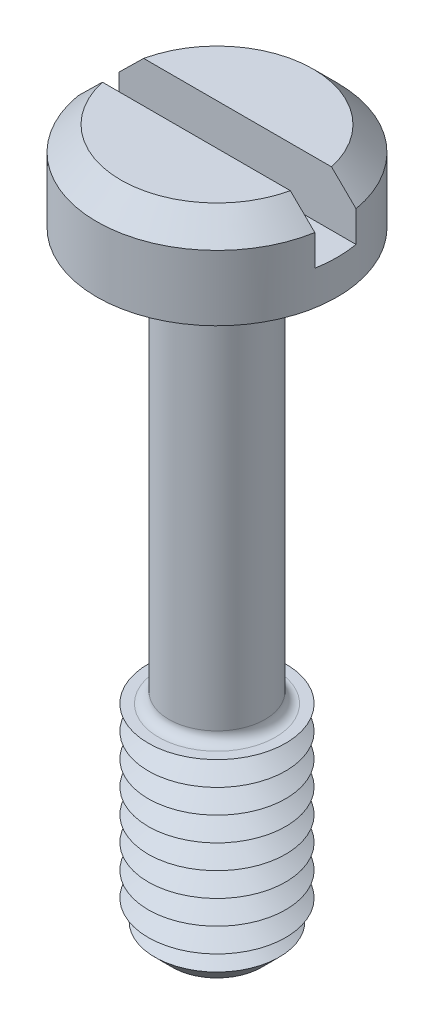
ISO-10303-21;
HEADER;
FILE_DESCRIPTION(('STEP AP214'),'2;1');
FILE_NAME('part.step','',(''),(''),'','','');
FILE_SCHEMA(('AUTOMOTIVE_DESIGN { 1 0 10303 214 1 1 1 1 }'));
ENDSEC;
DATA;
#1=APPLICATION_CONTEXT('core data for automotive mechanical design processes');
#2=APPLICATION_PROTOCOL_DEFINITION('international standard','automotive_design',2000,#1);
#3=PRODUCT_CONTEXT('',#1,'mechanical');
#4=PRODUCT('Part','Part','',(#3));
#5=PRODUCT_RELATED_PRODUCT_CATEGORY('part','',(#4));
#6=PRODUCT_DEFINITION_FORMATION('','',#4);
#7=PRODUCT_DEFINITION_CONTEXT('part definition',#1,'design');
#8=PRODUCT_DEFINITION('design','',#6,#7);
#9=PRODUCT_DEFINITION_SHAPE('','',#8);
#10=(LENGTH_UNIT() NAMED_UNIT(*) SI_UNIT(.MILLI.,.METRE.));
#11=(NAMED_UNIT(*) PLANE_ANGLE_UNIT() SI_UNIT($,.RADIAN.));
#12=(NAMED_UNIT(*) SI_UNIT($,.STERADIAN.) SOLID_ANGLE_UNIT());
#13=UNCERTAINTY_MEASURE_WITH_UNIT(LENGTH_MEASURE(1.E-05),#10,'distance_accuracy_value','');
#14=(GEOMETRIC_REPRESENTATION_CONTEXT(3) GLOBAL_UNCERTAINTY_ASSIGNED_CONTEXT((#13)) GLOBAL_UNIT_ASSIGNED_CONTEXT((#10,
#11,#12)) REPRESENTATION_CONTEXT('',''));
#15=CARTESIAN_POINT('',(0.,0.,0.));
#16=DIRECTION('',(0.,0.,1.));
#17=DIRECTION('',(1.,0.,0.));
#18=AXIS2_PLACEMENT_3D('',#15,#16,#17);
#19=CARTESIAN_POINT('',(0.,2.6,0.));
#20=DIRECTION('',(0.,1.,0.));
#21=DIRECTION('',(0.,0.,1.));
#22=AXIS2_PLACEMENT_3D('',#19,#20,#21);
#23=PLANE('',#22);
#24=DIRECTION('',(-1.,0.,0.));
#25=VECTOR('',#24,1.);
#26=CARTESIAN_POINT('',(3.5,2.6,-0.6));
#27=LINE('',#26,#25);
#28=CARTESIAN_POINT('',(2.73495886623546,2.6,-0.6));
#29=VERTEX_POINT('',#28);
#30=CARTESIAN_POINT('',(-2.73495886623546,2.6,-0.6));
#31=VERTEX_POINT('',#30);
#32=EDGE_CURVE('E110',#29,#31,#27,.T.);
#33=ORIENTED_EDGE('',*,*,#32,.F.);
#34=CARTESIAN_POINT('',(0.,2.6,0.));
#35=DIRECTION('',(0.,1.,0.));
#36=DIRECTION('',(0.,0.,1.));
#37=AXIS2_PLACEMENT_3D('',#34,#35,#36);
#38=CIRCLE('',#37,2.8);
#39=EDGE_CURVE('E113',#29,#31,#38,.T.);
#40=ORIENTED_EDGE('',*,*,#39,.T.);
#41=EDGE_LOOP('',(#33,#40));
#42=FACE_BOUND('',#41,.T.);
#43=ADVANCED_FACE('F39',(#42),#23,.T.);
#44=CARTESIAN_POINT('',(0.,2.6,0.));
#45=DIRECTION('',(0.,-1.,0.));
#46=DIRECTION('',(0.,0.,-1.));
#47=AXIS2_PLACEMENT_3D('',#44,#45,#46);
#48=CONICAL_SURFACE('',#47,2.8,0.785398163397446);
#49=CARTESIAN_POINT('',(7.69779986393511,-2.32114776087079,-0.6));
#50=CARTESIAN_POINT('',(7.42456340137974,-2.04874480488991,-0.6));
#51=CARTESIAN_POINT('',(7.15128998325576,-1.77637887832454,-0.6));
#52=CARTESIAN_POINT('',(6.6046077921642,-1.23176088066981,-0.6));
#53=CARTESIAN_POINT('',(6.3311990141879,-0.959508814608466,-0.6));
#54=CARTESIAN_POINT('',(5.78393918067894,-0.414914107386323,-0.6));
#55=CARTESIAN_POINT('',(5.51008795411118,-0.142571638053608,-0.6));
#56=CARTESIAN_POINT('',(4.96212493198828,0.401829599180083,-0.6));
#57=CARTESIAN_POINT('',(4.68801314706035,0.673888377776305,-0.6));
#58=CARTESIAN_POINT('',(4.15230810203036,1.20471714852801,-0.6));
#59=CARTESIAN_POINT('',(3.8907352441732,1.46350771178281,-0.6));
#60=CARTESIAN_POINT('',(3.49781694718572,1.85115830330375,-0.6));
#61=CARTESIAN_POINT('',(3.36674319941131,1.98029362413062,-0.6));
#62=CARTESIAN_POINT('',(3.10433907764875,2.23830030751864,-0.6));
#63=CARTESIAN_POINT('',(2.97300870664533,2.36717167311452,-0.6));
#64=CARTESIAN_POINT('',(2.71005235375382,2.62445652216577,-0.6));
#65=CARTESIAN_POINT('',(2.57842659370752,2.75287023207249,-0.6));
#66=CARTESIAN_POINT('',(2.31459302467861,3.00911021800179,-0.6));
#67=CARTESIAN_POINT('',(2.1823851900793,3.13693646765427,-0.6));
#68=CARTESIAN_POINT('',(1.91706128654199,3.39159289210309,-0.6));
#69=CARTESIAN_POINT('',(1.78394541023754,3.51842326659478,-0.6));
#70=CARTESIAN_POINT('',(1.5829745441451,3.70728046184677,-0.6));
#71=CARTESIAN_POINT('',(1.51577053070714,3.76999922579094,-0.6));
#72=CARTESIAN_POINT('',(1.38073587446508,3.89475766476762,-0.6));
#73=CARTESIAN_POINT('',(1.31290524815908,3.95679735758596,-0.6));
#74=CARTESIAN_POINT('',(1.20662362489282,4.05253127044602,-0.6));
#75=CARTESIAN_POINT('',(1.16849592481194,4.08658409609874,-0.6));
#76=CARTESIAN_POINT('',(1.09186306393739,4.15427097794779,-0.6));
#77=CARTESIAN_POINT('',(1.05335786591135,4.18790499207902,-0.6));
#78=CARTESIAN_POINT('',(0.975560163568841,4.25487029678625,-0.6));
#79=CARTESIAN_POINT('',(0.936263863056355,4.28819718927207,-0.6));
#80=CARTESIAN_POINT('',(0.85702368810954,4.35405392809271,-0.6));
#81=CARTESIAN_POINT('',(0.817079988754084,4.38658398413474,-0.6));
#82=CARTESIAN_POINT('',(0.735932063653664,4.45080389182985,-0.6));
#83=CARTESIAN_POINT('',(0.694719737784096,4.48248357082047,-0.6));
#84=CARTESIAN_POINT('',(0.611023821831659,4.54411116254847,-0.6));
#85=CARTESIAN_POINT('',(0.568540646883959,4.57405963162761,-0.6));
#86=CARTESIAN_POINT('',(0.482031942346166,4.63104137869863,-0.6));
#87=CARTESIAN_POINT('',(0.438018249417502,4.65809235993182,-0.6));
#88=CARTESIAN_POINT('',(0.347545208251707,4.70764477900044,-0.6));
#89=CARTESIAN_POINT('',(0.301093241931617,4.73015905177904,-0.6));
#90=CARTESIAN_POINT('',(0.216840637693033,4.76288589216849,-0.6));
#91=CARTESIAN_POINT('',(0.179711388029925,4.77476119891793,-0.6));
#92=CARTESIAN_POINT('',(0.104069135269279,4.79214056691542,-0.6));
#93=CARTESIAN_POINT('',(0.0655630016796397,4.79767265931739,-0.6));
#94=CARTESIAN_POINT('',(-0.0121083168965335,4.80113734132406,-0.6));
#95=CARTESIAN_POINT('',(-0.0512762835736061,4.79901215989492,-0.6));
#96=CARTESIAN_POINT('',(-0.128601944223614,4.78758103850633,-0.6));
#97=CARTESIAN_POINT('',(-0.166755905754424,4.77825158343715,-0.6));
#98=CARTESIAN_POINT('',(-0.23998525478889,4.75468984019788,-0.6));
#99=CARTESIAN_POINT('',(-0.27512131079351,4.74063623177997,-0.6));
#100=CARTESIAN_POINT('',(-0.343859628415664,4.70912771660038,-0.6));
#101=CARTESIAN_POINT('',(-0.377459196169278,4.69166709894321,-0.6));
#102=CARTESIAN_POINT('',(-0.443620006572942,4.65431398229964,-0.6));
#103=CARTESIAN_POINT('',(-0.476170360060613,4.63440256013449,-0.6));
#104=CARTESIAN_POINT('',(-0.54020885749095,4.59301144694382,-0.6));
#105=CARTESIAN_POINT('',(-0.571697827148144,4.57153301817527,-0.6));
#106=CARTESIAN_POINT('',(-0.636426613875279,4.52565712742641,-0.6));
#107=CARTESIAN_POINT('',(-0.669598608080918,4.50116466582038,-0.6));
#108=CARTESIAN_POINT('',(-0.735238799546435,4.45125092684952,-0.6));
#109=CARTESIAN_POINT('',(-0.767706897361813,4.42582951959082,-0.6));
#110=CARTESIAN_POINT('',(-0.864340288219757,4.34853769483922,-0.6));
#111=CARTESIAN_POINT('',(-0.92770092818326,4.29566444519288,-0.6));
#112=CARTESIAN_POINT('',(-1.05322030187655,4.18829389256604,-0.6));
#113=CARTESIAN_POINT('',(-1.11537654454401,4.13379371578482,-0.6));
#114=CARTESIAN_POINT('',(-1.23879800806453,4.02383276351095,-0.6));
#115=CARTESIAN_POINT('',(-1.30006349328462,3.96837228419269,-0.6));
#116=CARTESIAN_POINT('',(-1.42182653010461,3.85695373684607,-0.6));
#117=CARTESIAN_POINT('',(-1.4823257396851,3.80099747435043,-0.6));
#118=CARTESIAN_POINT('',(-1.60290045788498,3.68862177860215,-0.6));
#119=CARTESIAN_POINT('',(-1.66297593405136,3.63220231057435,-0.6));
#120=CARTESIAN_POINT('',(-1.84259490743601,3.46258196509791,-0.6));
#121=CARTESIAN_POINT('',(-1.96167258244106,3.3488883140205,-0.6));
#122=CARTESIAN_POINT('',(-2.19942862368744,3.12043467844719,-0.6));
#123=CARTESIAN_POINT('',(-2.3181049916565,3.00567262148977,-0.6));
#124=CARTESIAN_POINT('',(-2.55498513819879,2.77566147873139,-0.6));
#125=CARTESIAN_POINT('',(-2.67318891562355,2.66041239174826,-0.6));
#126=CARTESIAN_POINT('',(-3.02733776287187,2.31418176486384,-0.6));
#127=CARTESIAN_POINT('',(-3.26281496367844,2.08272206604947,-0.6));
#128=CARTESIAN_POINT('',(-3.73326607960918,1.61902814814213,-0.6));
#129=CARTESIAN_POINT('',(-3.96823963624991,1.38679356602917,-0.6));
#130=CARTESIAN_POINT('',(-4.43780370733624,0.921942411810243,-0.6));
#131=CARTESIAN_POINT('',(-4.67239422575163,0.689325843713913,-0.6));
#132=CARTESIAN_POINT('',(-5.13982382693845,0.225350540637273,-0.6));
#133=CARTESIAN_POINT('',(-5.37266445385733,-0.00600663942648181,-0.6));
#134=CARTESIAN_POINT('',(-5.8381854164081,-0.46888381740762,-0.6));
#135=CARTESIAN_POINT('',(-6.07086575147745,-0.700403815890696,-0.6));
#136=CARTESIAN_POINT('',(-6.5359692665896,-1.16341429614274,-0.6));
#137=CARTESIAN_POINT('',(-6.76839251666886,-1.39490470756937,-0.6));
#138=CARTESIAN_POINT('',(-7.23315324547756,-1.85796986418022,-0.6));
#139=CARTESIAN_POINT('',(-7.46549072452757,-2.08954460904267,-0.6));
#140=CARTESIAN_POINT('',(-7.69779986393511,-2.32114776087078,-0.6));
#141=B_SPLINE_CURVE_WITH_KNOTS('',3,(#49,#50,#51,#52,#53,#54,#55,#56,#57,#58,#59,#60,#61,#62,
#63,#64,#65,#66,#67,#68,#69,#70,#71,#72,#73,#74,#75,#76,#77,#78,#79,#80,#81,#82,#83,#84,#85,#86,
#87,#88,#89,#90,#91,#92,#93,#94,#95,#96,#97,#98,#99,#100,#101,#102,#103,#104,#105,#106,#107,
#108,#109,#110,#111,#112,#113,#114,#115,#116,#117,#118,#119,#120,#121,#122,#123,#124,#125,#126,
#127,#128,#129,#130,#131,#132,#133,#134,#135,#136,#137,#138,#139,#140),.UNSPECIFIED.,.F.,.F.,(4,
2,2,2,2,2,2,2,2,2,2,2,2,2,2,2,2,2,2,2,2,2,2,2,2,2,2,2,2,2,2,2,2,2,2,2,2,2,2,2,2,2,2,2,2,4),(0.,
1.15747738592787,2.31500139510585,3.47365747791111,4.63226817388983,5.73614050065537,
6.28814234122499,6.84013779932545,7.39180548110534,7.94349768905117,8.49507629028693,
8.7708456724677,9.04660781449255,9.19996738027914,9.35334222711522,9.50791164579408,
9.66243993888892,9.81835637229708,9.9742224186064,10.1290741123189,10.2834813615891,
10.4000294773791,10.5160605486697,10.6329688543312,10.7502603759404,10.8635386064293,
10.9770083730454,11.0914168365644,11.205734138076,11.3294140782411,11.4531113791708,
11.7006314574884,11.9486181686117,12.1965297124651,12.4437540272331,12.6909970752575,
13.184904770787,13.6801705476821,14.1754375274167,15.1659939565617,16.1571087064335,
17.1482131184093,18.1329303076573,19.1176509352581,20.1017623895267,21.0858701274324),.UNSPECIFIED.);
#142=CARTESIAN_POINT('',(3.44818792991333,1.89999999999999,-0.6));
#143=VERTEX_POINT('',#142);
#144=EDGE_CURVE('E259',#143,#29,#141,.T.);
#145=ORIENTED_EDGE('',*,*,#144,.F.);
#146=CARTESIAN_POINT('',(0.,1.89999999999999,0.));
#147=DIRECTION('',(0.,1.,0.));
#148=DIRECTION('',(0.,0.,1.));
#149=AXIS2_PLACEMENT_3D('',#146,#147,#148);
#150=CIRCLE('',#149,3.5);
#151=CARTESIAN_POINT('',(-3.44818792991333,1.89999999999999,-0.6));
#152=VERTEX_POINT('',#151);
#153=EDGE_CURVE('E128',#152,#143,#150,.F.);
#154=ORIENTED_EDGE('',*,*,#153,.F.);
#155=EDGE_CURVE('E102',#31,#152,#141,.T.);
#156=ORIENTED_EDGE('',*,*,#155,.F.);
#157=ORIENTED_EDGE('',*,*,#39,.F.);
#158=EDGE_LOOP('',(#145,#154,#156,#157));
#159=FACE_BOUND('',#158,.T.);
#160=ADVANCED_FACE('F222',(#159),#48,.T.);
#161=CARTESIAN_POINT('',(0.,-18.,0.));
#162=DIRECTION('',(0.,1.,0.));
#163=DIRECTION('',(0.,0.,1.));
#164=AXIS2_PLACEMENT_3D('',#161,#162,#163);
#165=CYLINDRICAL_SURFACE('',#164,1.4);
#166=CARTESIAN_POINT('',(0.,-11.7,0.));
#167=DIRECTION('',(0.,-1.,0.));
#168=DIRECTION('',(0.,0.,-1.));
#169=AXIS2_PLACEMENT_3D('',#166,#167,#168);
#170=CIRCLE('',#169,1.4);
#171=CARTESIAN_POINT('',(0.,-11.7,-1.4));
#172=VERTEX_POINT('',#171);
#173=EDGE_CURVE('E123',#172,#172,#170,.F.);
#174=ORIENTED_EDGE('',*,*,#173,.T.);
#175=EDGE_LOOP('',(#174));
#176=FACE_BOUND('',#175,.T.);
#177=CARTESIAN_POINT('',(0.,-0.300000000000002,0.));
#178=DIRECTION('',(0.,1.,0.));
#179=DIRECTION('',(0.,0.,1.));
#180=AXIS2_PLACEMENT_3D('',#177,#178,#179);
#181=CIRCLE('',#180,1.4);
#182=CARTESIAN_POINT('',(0.,-0.300000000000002,1.4));
#183=VERTEX_POINT('',#182);
#184=EDGE_CURVE('E366',#183,#183,#181,.F.);
#185=ORIENTED_EDGE('',*,*,#184,.T.);
#186=EDGE_LOOP('',(#185));
#187=FACE_BOUND('',#186,.T.);
#188=ADVANCED_FACE('F218',(#176,#187),#165,.T.);
#189=CARTESIAN_POINT('',(0.,2.6,0.));
#190=DIRECTION('',(0.,-1.,0.));
#191=DIRECTION('',(0.,0.,-1.));
#192=AXIS2_PLACEMENT_3D('',#189,#190,#191);
#193=CYLINDRICAL_SURFACE('',#192,3.5);
#194=ORIENTED_EDGE('',*,*,#153,.T.);
#195=DIRECTION('',(0.,-1.,0.));
#196=VECTOR('',#195,1.);
#197=CARTESIAN_POINT('',(3.44818792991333,2.6,-0.6));
#198=LINE('',#197,#196);
#199=CARTESIAN_POINT('',(3.44818792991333,1.,-0.6));
#200=VERTEX_POINT('',#199);
#201=EDGE_CURVE('E64',#143,#200,#198,.T.);
#202=ORIENTED_EDGE('',*,*,#201,.T.);
#203=CARTESIAN_POINT('',(0.,1.,0.));
#204=DIRECTION('',(0.,1.,0.));
#205=DIRECTION('',(0.,0.,1.));
#206=AXIS2_PLACEMENT_3D('',#203,#204,#205);
#207=CIRCLE('',#206,3.5);
#208=CARTESIAN_POINT('',(3.44818792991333,1.,0.6));
#209=VERTEX_POINT('',#208);
#210=EDGE_CURVE('E11',#209,#200,#207,.T.);
#211=ORIENTED_EDGE('',*,*,#210,.F.);
#212=DIRECTION('',(0.,-1.,0.));
#213=VECTOR('',#212,1.);
#214=CARTESIAN_POINT('',(3.44818792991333,2.6,0.6));
#215=LINE('',#214,#213);
#216=CARTESIAN_POINT('',(3.44818792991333,1.89999999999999,0.6));
#217=VERTEX_POINT('',#216);
#218=EDGE_CURVE('E276',#209,#217,#215,.F.);
#219=ORIENTED_EDGE('',*,*,#218,.T.);
#220=CARTESIAN_POINT('',(-3.44818792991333,1.89999999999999,0.6));
#221=VERTEX_POINT('',#220);
#222=EDGE_CURVE('E120',#217,#221,#150,.F.);
#223=ORIENTED_EDGE('',*,*,#222,.T.);
#224=DIRECTION('',(0.,-1.,0.));
#225=VECTOR('',#224,1.);
#226=CARTESIAN_POINT('',(-3.44818792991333,2.6,0.6));
#227=LINE('',#226,#225);
#228=CARTESIAN_POINT('',(-3.44818792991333,1.,0.6));
#229=VERTEX_POINT('',#228);
#230=EDGE_CURVE('E96',#221,#229,#227,.T.);
#231=ORIENTED_EDGE('',*,*,#230,.T.);
#232=CARTESIAN_POINT('',(-3.44818792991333,1.,-0.6));
#233=VERTEX_POINT('',#232);
#234=EDGE_CURVE('E44',#233,#229,#207,.T.);
#235=ORIENTED_EDGE('',*,*,#234,.F.);
#236=DIRECTION('',(0.,-1.,0.));
#237=VECTOR('',#236,1.);
#238=CARTESIAN_POINT('',(-3.44818792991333,2.6,-0.6));
#239=LINE('',#238,#237);
#240=EDGE_CURVE('E280',#233,#152,#239,.F.);
#241=ORIENTED_EDGE('',*,*,#240,.T.);
#242=EDGE_LOOP('',(#194,#202,#211,#219,#223,#231,#235,#241));
#243=FACE_BOUND('',#242,.T.);
#244=CARTESIAN_POINT('',(0.,0.,0.));
#245=DIRECTION('',(0.,1.,0.));
#246=DIRECTION('',(0.,0.,1.));
#247=AXIS2_PLACEMENT_3D('',#244,#245,#246);
#248=CIRCLE('',#247,3.5);
#249=CARTESIAN_POINT('',(0.,0.,3.5));
#250=VERTEX_POINT('',#249);
#251=EDGE_CURVE('E352',#250,#250,#248,.T.);
#252=ORIENTED_EDGE('',*,*,#251,.T.);
#253=EDGE_LOOP('',(#252));
#254=FACE_BOUND('',#253,.T.);
#255=ADVANCED_FACE('F221',(#243,#254),#193,.T.);
#256=DIRECTION('',(1.,0.,0.));
#257=VECTOR('',#256,1.);
#258=CARTESIAN_POINT('',(3.5,2.6,0.6));
#259=LINE('',#258,#257);
#260=CARTESIAN_POINT('',(-2.73495886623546,2.6,0.6));
#261=VERTEX_POINT('',#260);
#262=CARTESIAN_POINT('',(2.73495886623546,2.6,0.6));
#263=VERTEX_POINT('',#262);
#264=EDGE_CURVE('E56',#261,#263,#259,.T.);
#265=ORIENTED_EDGE('',*,*,#264,.F.);
#266=EDGE_CURVE('E108',#261,#263,#38,.T.);
#267=ORIENTED_EDGE('',*,*,#266,.T.);
#268=EDGE_LOOP('',(#265,#267));
#269=FACE_BOUND('',#268,.T.);
#270=ADVANCED_FACE('F107',(#269),#23,.T.);
#271=CARTESIAN_POINT('',(0.,0.,0.));
#272=DIRECTION('',(0.,1.,0.));
#273=DIRECTION('',(0.,0.,1.));
#274=AXIS2_PLACEMENT_3D('',#271,#272,#273);
#275=PLANE('',#274);
#276=CARTESIAN_POINT('',(0.,0.,0.));
#277=DIRECTION('',(0.,1.,0.));
#278=DIRECTION('',(0.,0.,1.));
#279=AXIS2_PLACEMENT_3D('',#276,#277,#278);
#280=CIRCLE('',#279,1.7);
#281=CARTESIAN_POINT('',(0.,0.,1.7));
#282=VERTEX_POINT('',#281);
#283=EDGE_CURVE('E114',#282,#282,#280,.T.);
#284=ORIENTED_EDGE('',*,*,#283,.T.);
#285=EDGE_LOOP('',(#284));
#286=FACE_BOUND('',#285,.T.);
#287=ORIENTED_EDGE('',*,*,#251,.F.);
#288=EDGE_LOOP('',(#287));
#289=FACE_BOUND('',#288,.T.);
#290=ADVANCED_FACE('F212',(#286,#289),#275,.F.);
#291=CARTESIAN_POINT('',(0.,-12.,0.));
#292=DIRECTION('',(0.,-1.,0.));
#293=DIRECTION('',(0.,0.,-1.));
#294=AXIS2_PLACEMENT_3D('',#291,#292,#293);
#295=PLANE('',#294);
#296=CARTESIAN_POINT('',(0.,-12.,0.));
#297=DIRECTION('',(0.,-1.,0.));
#298=DIRECTION('',(0.,0.,-1.));
#299=AXIS2_PLACEMENT_3D('',#296,#297,#298);
#300=CIRCLE('',#299,1.7);
#301=CARTESIAN_POINT('',(0.,-12.,-1.7));
#302=VERTEX_POINT('',#301);
#303=EDGE_CURVE('E360',#302,#302,#300,.T.);
#304=ORIENTED_EDGE('',*,*,#303,.T.);
#305=EDGE_LOOP('',(#304));
#306=FACE_BOUND('',#305,.T.);
#307=CARTESIAN_POINT('',(0.,-12.,0.));
#308=DIRECTION('',(0.,1.,0.));
#309=DIRECTION('',(0.,0.,1.));
#310=AXIS2_PLACEMENT_3D('',#307,#308,#309);
#311=CIRCLE('',#310,2.);
#312=CARTESIAN_POINT('',(0.,-12.,2.));
#313=VERTEX_POINT('',#312);
#314=EDGE_CURVE('E348',#313,#313,#311,.T.);
#315=ORIENTED_EDGE('',*,*,#314,.T.);
#316=EDGE_LOOP('',(#315));
#317=FACE_BOUND('',#316,.T.);
#318=ADVANCED_FACE('F208',(#306,#317),#295,.F.);
#319=CARTESIAN_POINT('',(0.,-12.35,0.));
#320=DIRECTION('',(0.,1.,0.));
#321=DIRECTION('',(0.,0.,1.));
#322=AXIS2_PLACEMENT_3D('',#319,#320,#321);
#323=CONICAL_SURFACE('',#322,1.39378221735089,1.04719755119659);
#324=ORIENTED_EDGE('',*,*,#314,.F.);
#325=EDGE_LOOP('',(#324));
#326=FACE_BOUND('',#325,.T.);
#327=CARTESIAN_POINT('',(0.,-12.35,0.));
#328=DIRECTION('',(0.,1.,0.));
#329=DIRECTION('',(0.,0.,1.));
#330=AXIS2_PLACEMENT_3D('',#327,#328,#329);
#331=CIRCLE('',#330,1.39378221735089);
#332=CARTESIAN_POINT('',(0.,-12.35,1.39378221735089));
#333=VERTEX_POINT('',#332);
#334=EDGE_CURVE('E344',#333,#333,#331,.T.);
#335=ORIENTED_EDGE('',*,*,#334,.T.);
#336=EDGE_LOOP('',(#335));
#337=FACE_BOUND('',#336,.T.);
#338=ADVANCED_FACE('F204',(#326,#337),#323,.T.);
#339=CARTESIAN_POINT('',(0.,-12.7,0.));
#340=DIRECTION('',(0.,-1.,0.));
#341=DIRECTION('',(0.,0.,-1.));
#342=AXIS2_PLACEMENT_3D('',#339,#340,#341);
#343=CONICAL_SURFACE('',#342,2.,1.0471975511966);
#344=ORIENTED_EDGE('',*,*,#334,.F.);
#345=EDGE_LOOP('',(#344));
#346=FACE_BOUND('',#345,.T.);
#347=CARTESIAN_POINT('',(0.,-12.7,0.));
#348=DIRECTION('',(0.,1.,0.));
#349=DIRECTION('',(0.,0.,1.));
#350=AXIS2_PLACEMENT_3D('',#347,#348,#349);
#351=CIRCLE('',#350,2.);
#352=CARTESIAN_POINT('',(0.,-12.7,2.));
#353=VERTEX_POINT('',#352);
#354=EDGE_CURVE('E340',#353,#353,#351,.T.);
#355=ORIENTED_EDGE('',*,*,#354,.T.);
#356=EDGE_LOOP('',(#355));
#357=FACE_BOUND('',#356,.T.);
#358=ADVANCED_FACE('F200',(#346,#357),#343,.T.);
#359=CARTESIAN_POINT('',(0.,-13.05,0.));
#360=DIRECTION('',(0.,1.,0.));
#361=DIRECTION('',(0.,0.,1.));
#362=AXIS2_PLACEMENT_3D('',#359,#360,#361);
#363=CONICAL_SURFACE('',#362,1.39378221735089,1.04719755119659);
#364=ORIENTED_EDGE('',*,*,#354,.F.);
#365=EDGE_LOOP('',(#364));
#366=FACE_BOUND('',#365,.T.);
#367=CARTESIAN_POINT('',(0.,-13.05,0.));
#368=DIRECTION('',(0.,1.,0.));
#369=DIRECTION('',(0.,0.,1.));
#370=AXIS2_PLACEMENT_3D('',#367,#368,#369);
#371=CIRCLE('',#370,1.39378221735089);
#372=CARTESIAN_POINT('',(0.,-13.05,1.39378221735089));
#373=VERTEX_POINT('',#372);
#374=EDGE_CURVE('E336',#373,#373,#371,.T.);
#375=ORIENTED_EDGE('',*,*,#374,.T.);
#376=EDGE_LOOP('',(#375));
#377=FACE_BOUND('',#376,.T.);
#378=ADVANCED_FACE('F196',(#366,#377),#363,.T.);
#379=CARTESIAN_POINT('',(0.,-13.4,0.));
#380=DIRECTION('',(0.,-1.,0.));
#381=DIRECTION('',(0.,0.,-1.));
#382=AXIS2_PLACEMENT_3D('',#379,#380,#381);
#383=CONICAL_SURFACE('',#382,2.,1.0471975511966);
#384=ORIENTED_EDGE('',*,*,#374,.F.);
#385=EDGE_LOOP('',(#384));
#386=FACE_BOUND('',#385,.T.);
#387=CARTESIAN_POINT('',(0.,-13.4,0.));
#388=DIRECTION('',(0.,1.,0.));
#389=DIRECTION('',(0.,0.,1.));
#390=AXIS2_PLACEMENT_3D('',#387,#388,#389);
#391=CIRCLE('',#390,2.);
#392=CARTESIAN_POINT('',(0.,-13.4,2.));
#393=VERTEX_POINT('',#392);
#394=EDGE_CURVE('E332',#393,#393,#391,.T.);
#395=ORIENTED_EDGE('',*,*,#394,.T.);
#396=EDGE_LOOP('',(#395));
#397=FACE_BOUND('',#396,.T.);
#398=ADVANCED_FACE('F192',(#386,#397),#383,.T.);
#399=CARTESIAN_POINT('',(0.,-13.75,0.));
#400=DIRECTION('',(0.,1.,0.));
#401=DIRECTION('',(0.,0.,1.));
#402=AXIS2_PLACEMENT_3D('',#399,#400,#401);
#403=CONICAL_SURFACE('',#402,1.39378221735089,1.04719755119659);
#404=ORIENTED_EDGE('',*,*,#394,.F.);
#405=EDGE_LOOP('',(#404));
#406=FACE_BOUND('',#405,.T.);
#407=CARTESIAN_POINT('',(0.,-13.75,0.));
#408=DIRECTION('',(0.,1.,0.));
#409=DIRECTION('',(0.,0.,1.));
#410=AXIS2_PLACEMENT_3D('',#407,#408,#409);
#411=CIRCLE('',#410,1.39378221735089);
#412=CARTESIAN_POINT('',(0.,-13.75,1.39378221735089));
#413=VERTEX_POINT('',#412);
#414=EDGE_CURVE('E328',#413,#413,#411,.T.);
#415=ORIENTED_EDGE('',*,*,#414,.T.);
#416=EDGE_LOOP('',(#415));
#417=FACE_BOUND('',#416,.T.);
#418=ADVANCED_FACE('F188',(#406,#417),#403,.T.);
#419=CARTESIAN_POINT('',(0.,-14.1,0.));
#420=DIRECTION('',(0.,-1.,0.));
#421=DIRECTION('',(0.,0.,-1.));
#422=AXIS2_PLACEMENT_3D('',#419,#420,#421);
#423=CONICAL_SURFACE('',#422,2.,1.0471975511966);
#424=ORIENTED_EDGE('',*,*,#414,.F.);
#425=EDGE_LOOP('',(#424));
#426=FACE_BOUND('',#425,.T.);
#427=CARTESIAN_POINT('',(0.,-14.1,0.));
#428=DIRECTION('',(0.,1.,0.));
#429=DIRECTION('',(0.,0.,1.));
#430=AXIS2_PLACEMENT_3D('',#427,#428,#429);
#431=CIRCLE('',#430,2.);
#432=CARTESIAN_POINT('',(0.,-14.1,2.));
#433=VERTEX_POINT('',#432);
#434=EDGE_CURVE('E324',#433,#433,#431,.T.);
#435=ORIENTED_EDGE('',*,*,#434,.T.);
#436=EDGE_LOOP('',(#435));
#437=FACE_BOUND('',#436,.T.);
#438=ADVANCED_FACE('F184',(#426,#437),#423,.T.);
#439=CARTESIAN_POINT('',(0.,-14.45,0.));
#440=DIRECTION('',(0.,1.,0.));
#441=DIRECTION('',(0.,0.,1.));
#442=AXIS2_PLACEMENT_3D('',#439,#440,#441);
#443=CONICAL_SURFACE('',#442,1.39378221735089,1.04719755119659);
#444=ORIENTED_EDGE('',*,*,#434,.F.);
#445=EDGE_LOOP('',(#444));
#446=FACE_BOUND('',#445,.T.);
#447=CARTESIAN_POINT('',(0.,-14.45,0.));
#448=DIRECTION('',(0.,1.,0.));
#449=DIRECTION('',(0.,0.,1.));
#450=AXIS2_PLACEMENT_3D('',#447,#448,#449);
#451=CIRCLE('',#450,1.39378221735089);
#452=CARTESIAN_POINT('',(0.,-14.45,1.39378221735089));
#453=VERTEX_POINT('',#452);
#454=EDGE_CURVE('E321',#453,#453,#451,.T.);
#455=ORIENTED_EDGE('',*,*,#454,.T.);
#456=EDGE_LOOP('',(#455));
#457=FACE_BOUND('',#456,.T.);
#458=ADVANCED_FACE('F180',(#446,#457),#443,.T.);
#459=CARTESIAN_POINT('',(0.,-14.8,0.));
#460=DIRECTION('',(0.,-1.,0.));
#461=DIRECTION('',(0.,0.,-1.));
#462=AXIS2_PLACEMENT_3D('',#459,#460,#461);
#463=CONICAL_SURFACE('',#462,2.,1.0471975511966);
#464=ORIENTED_EDGE('',*,*,#454,.F.);
#465=EDGE_LOOP('',(#464));
#466=FACE_BOUND('',#465,.T.);
#467=CARTESIAN_POINT('',(0.,-14.8,0.));
#468=DIRECTION('',(0.,1.,0.));
#469=DIRECTION('',(0.,0.,1.));
#470=AXIS2_PLACEMENT_3D('',#467,#468,#469);
#471=CIRCLE('',#470,2.);
#472=CARTESIAN_POINT('',(0.,-14.8,2.));
#473=VERTEX_POINT('',#472);
#474=EDGE_CURVE('E317',#473,#473,#471,.T.);
#475=ORIENTED_EDGE('',*,*,#474,.T.);
#476=EDGE_LOOP('',(#475));
#477=FACE_BOUND('',#476,.T.);
#478=ADVANCED_FACE('F176',(#466,#477),#463,.T.);
#479=CARTESIAN_POINT('',(0.,-15.15,0.));
#480=DIRECTION('',(0.,1.,0.));
#481=DIRECTION('',(0.,0.,1.));
#482=AXIS2_PLACEMENT_3D('',#479,#480,#481);
#483=CONICAL_SURFACE('',#482,1.39378221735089,1.04719755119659);
#484=ORIENTED_EDGE('',*,*,#474,.F.);
#485=EDGE_LOOP('',(#484));
#486=FACE_BOUND('',#485,.T.);
#487=CARTESIAN_POINT('',(0.,-15.15,0.));
#488=DIRECTION('',(0.,1.,0.));
#489=DIRECTION('',(0.,0.,1.));
#490=AXIS2_PLACEMENT_3D('',#487,#488,#489);
#491=CIRCLE('',#490,1.39378221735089);
#492=CARTESIAN_POINT('',(0.,-15.15,1.39378221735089));
#493=VERTEX_POINT('',#492);
#494=EDGE_CURVE('E313',#493,#493,#491,.T.);
#495=ORIENTED_EDGE('',*,*,#494,.T.);
#496=EDGE_LOOP('',(#495));
#497=FACE_BOUND('',#496,.T.);
#498=ADVANCED_FACE('F172',(#486,#497),#483,.T.);
#499=CARTESIAN_POINT('',(0.,-15.5,0.));
#500=DIRECTION('',(0.,-1.,0.));
#501=DIRECTION('',(0.,0.,-1.));
#502=AXIS2_PLACEMENT_3D('',#499,#500,#501);
#503=CONICAL_SURFACE('',#502,2.,1.0471975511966);
#504=ORIENTED_EDGE('',*,*,#494,.F.);
#505=EDGE_LOOP('',(#504));
#506=FACE_BOUND('',#505,.T.);
#507=CARTESIAN_POINT('',(0.,-15.5,0.));
#508=DIRECTION('',(0.,1.,0.));
#509=DIRECTION('',(0.,0.,1.));
#510=AXIS2_PLACEMENT_3D('',#507,#508,#509);
#511=CIRCLE('',#510,2.);
#512=CARTESIAN_POINT('',(0.,-15.5,2.));
#513=VERTEX_POINT('',#512);
#514=EDGE_CURVE('E310',#513,#513,#511,.T.);
#515=ORIENTED_EDGE('',*,*,#514,.T.);
#516=EDGE_LOOP('',(#515));
#517=FACE_BOUND('',#516,.T.);
#518=ADVANCED_FACE('F168',(#506,#517),#503,.T.);
#519=CARTESIAN_POINT('',(0.,-15.85,0.));
#520=DIRECTION('',(0.,1.,0.));
#521=DIRECTION('',(0.,0.,1.));
#522=AXIS2_PLACEMENT_3D('',#519,#520,#521);
#523=CONICAL_SURFACE('',#522,1.39378221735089,1.04719755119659);
#524=ORIENTED_EDGE('',*,*,#514,.F.);
#525=EDGE_LOOP('',(#524));
#526=FACE_BOUND('',#525,.T.);
#527=CARTESIAN_POINT('',(0.,-15.85,0.));
#528=DIRECTION('',(0.,1.,0.));
#529=DIRECTION('',(0.,0.,1.));
#530=AXIS2_PLACEMENT_3D('',#527,#528,#529);
#531=CIRCLE('',#530,1.39378221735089);
#532=CARTESIAN_POINT('',(0.,-15.85,1.39378221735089));
#533=VERTEX_POINT('',#532);
#534=EDGE_CURVE('E306',#533,#533,#531,.T.);
#535=ORIENTED_EDGE('',*,*,#534,.T.);
#536=EDGE_LOOP('',(#535));
#537=FACE_BOUND('',#536,.T.);
#538=ADVANCED_FACE('F164',(#526,#537),#523,.T.);
#539=CARTESIAN_POINT('',(0.,-16.2,0.));
#540=DIRECTION('',(0.,-1.,0.));
#541=DIRECTION('',(0.,0.,-1.));
#542=AXIS2_PLACEMENT_3D('',#539,#540,#541);
#543=CONICAL_SURFACE('',#542,2.,1.0471975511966);
#544=ORIENTED_EDGE('',*,*,#534,.F.);
#545=EDGE_LOOP('',(#544));
#546=FACE_BOUND('',#545,.T.);
#547=CARTESIAN_POINT('',(0.,-16.2,0.));
#548=DIRECTION('',(0.,1.,0.));
#549=DIRECTION('',(0.,0.,1.));
#550=AXIS2_PLACEMENT_3D('',#547,#548,#549);
#551=CIRCLE('',#550,2.);
#552=CARTESIAN_POINT('',(0.,-16.2,2.));
#553=VERTEX_POINT('',#552);
#554=EDGE_CURVE('E302',#553,#553,#551,.T.);
#555=ORIENTED_EDGE('',*,*,#554,.T.);
#556=EDGE_LOOP('',(#555));
#557=FACE_BOUND('',#556,.T.);
#558=ADVANCED_FACE('F160',(#546,#557),#543,.T.);
#559=CARTESIAN_POINT('',(0.,-16.55,0.));
#560=DIRECTION('',(0.,1.,0.));
#561=DIRECTION('',(0.,0.,1.));
#562=AXIS2_PLACEMENT_3D('',#559,#560,#561);
#563=CONICAL_SURFACE('',#562,1.39378221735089,1.04719755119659);
#564=ORIENTED_EDGE('',*,*,#554,.F.);
#565=EDGE_LOOP('',(#564));
#566=FACE_BOUND('',#565,.T.);
#567=CARTESIAN_POINT('',(0.,-16.55,0.));
#568=DIRECTION('',(0.,1.,0.));
#569=DIRECTION('',(0.,0.,1.));
#570=AXIS2_PLACEMENT_3D('',#567,#568,#569);
#571=CIRCLE('',#570,1.39378221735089);
#572=CARTESIAN_POINT('',(0.,-16.55,1.39378221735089));
#573=VERTEX_POINT('',#572);
#574=EDGE_CURVE('E299',#573,#573,#571,.T.);
#575=ORIENTED_EDGE('',*,*,#574,.T.);
#576=EDGE_LOOP('',(#575));
#577=FACE_BOUND('',#576,.T.);
#578=ADVANCED_FACE('F156',(#566,#577),#563,.T.);
#579=CARTESIAN_POINT('',(0.,-16.9,0.));
#580=DIRECTION('',(0.,-1.,0.));
#581=DIRECTION('',(0.,0.,-1.));
#582=AXIS2_PLACEMENT_3D('',#579,#580,#581);
#583=CONICAL_SURFACE('',#582,2.,1.0471975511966);
#584=ORIENTED_EDGE('',*,*,#574,.F.);
#585=EDGE_LOOP('',(#584));
#586=FACE_BOUND('',#585,.T.);
#587=CARTESIAN_POINT('',(0.,-16.9,0.));
#588=DIRECTION('',(0.,1.,0.));
#589=DIRECTION('',(0.,0.,1.));
#590=AXIS2_PLACEMENT_3D('',#587,#588,#589);
#591=CIRCLE('',#590,2.);
#592=CARTESIAN_POINT('',(0.,-16.9,2.));
#593=VERTEX_POINT('',#592);
#594=EDGE_CURVE('E294',#593,#593,#591,.T.);
#595=ORIENTED_EDGE('',*,*,#594,.T.);
#596=EDGE_LOOP('',(#595));
#597=FACE_BOUND('',#596,.T.);
#598=ADVANCED_FACE('F152',(#586,#597),#583,.T.);
#599=CARTESIAN_POINT('',(0.,-17.25,0.));
#600=DIRECTION('',(0.,1.,0.));
#601=DIRECTION('',(0.,0.,1.));
#602=AXIS2_PLACEMENT_3D('',#599,#600,#601);
#603=CONICAL_SURFACE('',#602,1.39378221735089,1.04719755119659);
#604=ORIENTED_EDGE('',*,*,#594,.F.);
#605=EDGE_LOOP('',(#604));
#606=FACE_BOUND('',#605,.T.);
#607=CARTESIAN_POINT('',(0.,-17.25,0.));
#608=DIRECTION('',(0.,1.,0.));
#609=DIRECTION('',(0.,0.,1.));
#610=AXIS2_PLACEMENT_3D('',#607,#608,#609);
#611=CIRCLE('',#610,1.39378221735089);
#612=CARTESIAN_POINT('',(0.,-17.25,1.39378221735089));
#613=VERTEX_POINT('',#612);
#614=EDGE_CURVE('E290',#613,#613,#611,.T.);
#615=ORIENTED_EDGE('',*,*,#614,.T.);
#616=EDGE_LOOP('',(#615));
#617=FACE_BOUND('',#616,.T.);
#618=ADVANCED_FACE('F148',(#606,#617),#603,.T.);
#619=CARTESIAN_POINT('',(0.,-17.6,0.));
#620=DIRECTION('',(0.,-1.,0.));
#621=DIRECTION('',(0.,0.,-1.));
#622=AXIS2_PLACEMENT_3D('',#619,#620,#621);
#623=CONICAL_SURFACE('',#622,2.,1.0471975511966);
#624=CARTESIAN_POINT('',(0.,-17.4901923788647,0.));
#625=DIRECTION('',(0.,-1.,0.));
#626=DIRECTION('',(0.,0.,-1.));
#627=AXIS2_PLACEMENT_3D('',#624,#625,#626);
#628=CIRCLE('',#627,1.80980762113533);
#629=CARTESIAN_POINT('',(0.,-17.4901923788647,-1.80980762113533));
#630=VERTEX_POINT('',#629);
#631=EDGE_CURVE('E298',#630,#630,#628,.F.);
#632=ORIENTED_EDGE('',*,*,#631,.T.);
#633=EDGE_LOOP('',(#632));
#634=FACE_BOUND('',#633,.T.);
#635=ORIENTED_EDGE('',*,*,#614,.F.);
#636=EDGE_LOOP('',(#635));
#637=FACE_BOUND('',#636,.T.);
#638=ADVANCED_FACE('F144',(#634,#637),#623,.T.);
#639=CARTESIAN_POINT('',(0.,-18.,0.));
#640=DIRECTION('',(0.,-1.,0.));
#641=DIRECTION('',(0.,0.,-1.));
#642=AXIS2_PLACEMENT_3D('',#639,#640,#641);
#643=PLANE('',#642);
#644=CARTESIAN_POINT('',(0.,-18.,0.));
#645=DIRECTION('',(0.,-1.,0.));
#646=DIRECTION('',(0.,0.,-1.));
#647=AXIS2_PLACEMENT_3D('',#644,#645,#646);
#648=CIRCLE('',#647,1.3);
#649=CARTESIAN_POINT('',(0.,-18.,-1.3));
#650=VERTEX_POINT('',#649);
#651=EDGE_CURVE('E356',#650,#650,#648,.T.);
#652=ORIENTED_EDGE('',*,*,#651,.T.);
#653=EDGE_LOOP('',(#652));
#654=FACE_BOUND('',#653,.T.);
#655=ADVANCED_FACE('F147',(#654),#643,.T.);
#656=CARTESIAN_POINT('',(0.,-18.,0.));
#657=DIRECTION('',(0.,1.,0.));
#658=DIRECTION('',(0.,0.,1.));
#659=AXIS2_PLACEMENT_3D('',#656,#657,#658);
#660=CONICAL_SURFACE('',#659,1.3,0.785398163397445);
#661=ORIENTED_EDGE('',*,*,#631,.F.);
#662=EDGE_LOOP('',(#661));
#663=FACE_BOUND('',#662,.T.);
#664=ORIENTED_EDGE('',*,*,#651,.F.);
#665=EDGE_LOOP('',(#664));
#666=FACE_BOUND('',#665,.T.);
#667=ADVANCED_FACE('F216',(#663,#666),#660,.T.);
#668=CARTESIAN_POINT('',(0.,-11.7,0.));
#669=DIRECTION('',(0.,-1.,0.));
#670=DIRECTION('',(0.,0.,-1.));
#671=AXIS2_PLACEMENT_3D('',#668,#669,#670);
#672=TOROIDAL_SURFACE('',#671,1.7,0.3);
#673=ORIENTED_EDGE('',*,*,#173,.F.);
#674=EDGE_LOOP('',(#673));
#675=FACE_BOUND('',#674,.T.);
#676=ORIENTED_EDGE('',*,*,#303,.F.);
#677=EDGE_LOOP('',(#676));
#678=FACE_BOUND('',#677,.T.);
#679=ADVANCED_FACE('F234',(#675,#678),#672,.F.);
#680=CARTESIAN_POINT('',(0.,-0.300000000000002,0.));
#681=DIRECTION('',(0.,1.,0.));
#682=DIRECTION('',(0.,0.,1.));
#683=AXIS2_PLACEMENT_3D('',#680,#681,#682);
#684=TOROIDAL_SURFACE('',#683,1.7,0.3);
#685=ORIENTED_EDGE('',*,*,#283,.F.);
#686=EDGE_LOOP('',(#685));
#687=FACE_BOUND('',#686,.T.);
#688=ORIENTED_EDGE('',*,*,#184,.F.);
#689=EDGE_LOOP('',(#688));
#690=FACE_BOUND('',#689,.T.);
#691=ADVANCED_FACE('F237',(#687,#690),#684,.F.);
#692=CARTESIAN_POINT('',(-7.69779986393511,-2.32114776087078,0.6));
#693=CARTESIAN_POINT('',(-7.42456340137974,-2.04874480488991,0.6));
#694=CARTESIAN_POINT('',(-7.15128998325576,-1.77637887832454,0.6));
#695=CARTESIAN_POINT('',(-6.60460779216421,-1.23176088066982,0.6));
#696=CARTESIAN_POINT('',(-6.3311990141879,-0.959508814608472,0.6));
#697=CARTESIAN_POINT('',(-5.78393918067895,-0.414914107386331,0.6));
#698=CARTESIAN_POINT('',(-5.51008795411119,-0.142571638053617,0.6));
#699=CARTESIAN_POINT('',(-4.96212493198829,0.401829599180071,0.6));
#700=CARTESIAN_POINT('',(-4.68801314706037,0.673888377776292,0.6));
#701=CARTESIAN_POINT('',(-4.15230810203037,1.204717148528,0.6));
#702=CARTESIAN_POINT('',(-3.89073524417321,1.4635077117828,0.6));
#703=CARTESIAN_POINT('',(-3.49781694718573,1.85115830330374,0.6));
#704=CARTESIAN_POINT('',(-3.36674319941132,1.98029362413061,0.6));
#705=CARTESIAN_POINT('',(-3.10433907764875,2.23830030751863,0.6));
#706=CARTESIAN_POINT('',(-2.97300870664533,2.36717167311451,0.6));
#707=CARTESIAN_POINT('',(-2.71005235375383,2.62445652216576,0.6));
#708=CARTESIAN_POINT('',(-2.57842659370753,2.75287023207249,0.6));
#709=CARTESIAN_POINT('',(-2.31459302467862,3.00911021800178,0.6));
#710=CARTESIAN_POINT('',(-2.1823851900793,3.13693646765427,0.6));
#711=CARTESIAN_POINT('',(-1.91706128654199,3.39159289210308,0.6));
#712=CARTESIAN_POINT('',(-1.78394541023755,3.51842326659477,0.6));
#713=CARTESIAN_POINT('',(-1.58297454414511,3.70728046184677,0.6));
#714=CARTESIAN_POINT('',(-1.51577053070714,3.76999922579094,0.6));
#715=CARTESIAN_POINT('',(-1.38073587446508,3.89475766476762,0.6));
#716=CARTESIAN_POINT('',(-1.31290524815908,3.95679735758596,0.6));
#717=CARTESIAN_POINT('',(-1.20662362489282,4.05253127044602,0.6));
#718=CARTESIAN_POINT('',(-1.16849592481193,4.08658409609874,0.6));
#719=CARTESIAN_POINT('',(-1.09186306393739,4.15427097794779,0.6));
#720=CARTESIAN_POINT('',(-1.05335786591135,4.18790499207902,0.6));
#721=CARTESIAN_POINT('',(-0.97556016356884,4.25487029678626,0.6));
#722=CARTESIAN_POINT('',(-0.936263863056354,4.28819718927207,0.6));
#723=CARTESIAN_POINT('',(-0.85702368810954,4.35405392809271,0.6));
#724=CARTESIAN_POINT('',(-0.817079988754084,4.38658398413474,0.6));
#725=CARTESIAN_POINT('',(-0.735932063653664,4.45080389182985,0.6));
#726=CARTESIAN_POINT('',(-0.694719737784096,4.48248357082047,0.6));
#727=CARTESIAN_POINT('',(-0.611023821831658,4.54411116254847,0.6));
#728=CARTESIAN_POINT('',(-0.568540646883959,4.57405963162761,0.6));
#729=CARTESIAN_POINT('',(-0.482031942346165,4.63104137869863,0.6));
#730=CARTESIAN_POINT('',(-0.438018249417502,4.65809235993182,0.6));
#731=CARTESIAN_POINT('',(-0.347545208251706,4.70764477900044,0.6));
#732=CARTESIAN_POINT('',(-0.301093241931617,4.73015905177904,0.6));
#733=CARTESIAN_POINT('',(-0.216840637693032,4.76288589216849,0.6));
#734=CARTESIAN_POINT('',(-0.179711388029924,4.77476119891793,0.6));
#735=CARTESIAN_POINT('',(-0.104069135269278,4.79214056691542,0.6));
#736=CARTESIAN_POINT('',(-0.0655630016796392,4.79767265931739,0.6));
#737=CARTESIAN_POINT('',(0.012108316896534,4.80113734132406,0.6));
#738=CARTESIAN_POINT('',(0.0512762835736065,4.79901215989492,0.6));
#739=CARTESIAN_POINT('',(0.128601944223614,4.78758103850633,0.6));
#740=CARTESIAN_POINT('',(0.166755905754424,4.77825158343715,0.6));
#741=CARTESIAN_POINT('',(0.239985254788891,4.75468984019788,0.6));
#742=CARTESIAN_POINT('',(0.275121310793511,4.74063623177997,0.6));
#743=CARTESIAN_POINT('',(0.343859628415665,4.70912771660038,0.6));
#744=CARTESIAN_POINT('',(0.377459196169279,4.69166709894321,0.6));
#745=CARTESIAN_POINT('',(0.443620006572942,4.65431398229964,0.6));
#746=CARTESIAN_POINT('',(0.476170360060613,4.63440256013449,0.6));
#747=CARTESIAN_POINT('',(0.54020885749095,4.59301144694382,0.6));
#748=CARTESIAN_POINT('',(0.571697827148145,4.57153301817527,0.6));
#749=CARTESIAN_POINT('',(0.636426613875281,4.52565712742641,0.6));
#750=CARTESIAN_POINT('',(0.66959860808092,4.50116466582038,0.6));
#751=CARTESIAN_POINT('',(0.735238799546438,4.45125092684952,0.6));
#752=CARTESIAN_POINT('',(0.767706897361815,4.42582951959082,0.6));
#753=CARTESIAN_POINT('',(0.864340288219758,4.34853769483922,0.6));
#754=CARTESIAN_POINT('',(0.927700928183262,4.29566444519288,0.6));
#755=CARTESIAN_POINT('',(1.05322030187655,4.18829389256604,0.6));
#756=CARTESIAN_POINT('',(1.11537654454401,4.13379371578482,0.6));
#757=CARTESIAN_POINT('',(1.23879800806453,4.02383276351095,0.6));
#758=CARTESIAN_POINT('',(1.30006349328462,3.96837228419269,0.6));
#759=CARTESIAN_POINT('',(1.42182653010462,3.85695373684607,0.6));
#760=CARTESIAN_POINT('',(1.4823257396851,3.80099747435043,0.6));
#761=CARTESIAN_POINT('',(1.60290045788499,3.68862177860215,0.6));
#762=CARTESIAN_POINT('',(1.66297593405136,3.63220231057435,0.6));
#763=CARTESIAN_POINT('',(1.84259490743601,3.4625819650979,0.6));
#764=CARTESIAN_POINT('',(1.96167258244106,3.3488883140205,0.6));
#765=CARTESIAN_POINT('',(2.19942862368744,3.12043467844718,0.6));
#766=CARTESIAN_POINT('',(2.3181049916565,3.00567262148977,0.6));
#767=CARTESIAN_POINT('',(2.55498513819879,2.77566147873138,0.6));
#768=CARTESIAN_POINT('',(2.67318891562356,2.66041239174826,0.6));
#769=CARTESIAN_POINT('',(3.02733776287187,2.31418176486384,0.6));
#770=CARTESIAN_POINT('',(3.26281496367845,2.08272206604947,0.6));
#771=CARTESIAN_POINT('',(3.73326607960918,1.61902814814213,0.6));
#772=CARTESIAN_POINT('',(3.96823963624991,1.38679356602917,0.6));
#773=CARTESIAN_POINT('',(4.43780370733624,0.921942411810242,0.6));
#774=CARTESIAN_POINT('',(4.67239422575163,0.689325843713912,0.6));
#775=CARTESIAN_POINT('',(5.13982382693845,0.225350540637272,0.6));
#776=CARTESIAN_POINT('',(5.37266445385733,-0.0060066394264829,0.6));
#777=CARTESIAN_POINT('',(5.8381854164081,-0.46888381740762,0.6));
#778=CARTESIAN_POINT('',(6.07086575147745,-0.700403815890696,0.6));
#779=CARTESIAN_POINT('',(6.5359692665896,-1.16341429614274,0.6));
#780=CARTESIAN_POINT('',(6.76839251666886,-1.39490470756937,0.6));
#781=CARTESIAN_POINT('',(7.23315324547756,-1.85796986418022,0.6));
#782=CARTESIAN_POINT('',(7.46549072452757,-2.08954460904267,0.6));
#783=CARTESIAN_POINT('',(7.69779986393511,-2.32114776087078,0.6));
#784=B_SPLINE_CURVE_WITH_KNOTS('',3,(#692,#693,#694,#695,#696,#697,#698,#699,#700,#701,#702,
#703,#704,#705,#706,#707,#708,#709,#710,#711,#712,#713,#714,#715,#716,#717,#718,#719,#720,#721,
#722,#723,#724,#725,#726,#727,#728,#729,#730,#731,#732,#733,#734,#735,#736,#737,#738,#739,#740,
#741,#742,#743,#744,#745,#746,#747,#748,#749,#750,#751,#752,#753,#754,#755,#756,#757,#758,#759,
#760,#761,#762,#763,#764,#765,#766,#767,#768,#769,#770,#771,#772,#773,#774,#775,#776,#777,#778,
#779,#780,#781,#782,#783),.UNSPECIFIED.,.F.,.F.,(4,2,2,2,2,2,2,2,2,2,2,2,2,2,2,2,2,2,2,2,2,2,2,
2,2,2,2,2,2,2,2,2,2,2,2,2,2,2,2,2,2,2,2,2,2,4),(0.,1.15747738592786,2.31500139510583,
3.47365747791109,4.6322681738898,5.73614050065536,6.28814234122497,6.84013779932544,
7.39180548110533,7.94349768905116,8.49507629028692,8.7708456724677,9.04660781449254,
9.19996738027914,9.35334222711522,9.50791164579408,9.66243993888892,9.81835637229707,
9.97422241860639,10.1290741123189,10.2834813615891,10.4000294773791,10.5160605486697,
10.6329688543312,10.7502603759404,10.8635386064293,10.9770083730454,11.0914168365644,
11.205734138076,11.3294140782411,11.4531113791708,11.7006314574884,11.9486181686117,
12.1965297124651,12.4437540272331,12.6909970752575,13.184904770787,13.6801705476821,
14.1754375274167,15.1659939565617,16.1571087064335,17.1482131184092,18.1329303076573,
19.1176509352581,20.1017623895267,21.0858701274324),.UNSPECIFIED.);
#785=EDGE_CURVE('E92',#221,#261,#784,.T.);
#786=ORIENTED_EDGE('',*,*,#785,.F.);
#787=ORIENTED_EDGE('',*,*,#222,.F.);
#788=EDGE_CURVE('E103',#263,#217,#784,.T.);
#789=ORIENTED_EDGE('',*,*,#788,.F.);
#790=ORIENTED_EDGE('',*,*,#266,.F.);
#791=EDGE_LOOP('',(#786,#787,#789,#790));
#792=FACE_BOUND('',#791,.T.);
#793=ADVANCED_FACE('F41',(#792),#48,.T.);
#794=CARTESIAN_POINT('',(0.,1.,0.));
#795=DIRECTION('',(0.,1.,0.));
#796=DIRECTION('',(0.,0.,1.));
#797=AXIS2_PLACEMENT_3D('',#794,#795,#796);
#798=PLANE('',#797);
#799=DIRECTION('',(1.,0.,0.));
#800=VECTOR('',#799,1.);
#801=CARTESIAN_POINT('',(3.5,1.,0.6));
#802=LINE('',#801,#800);
#803=EDGE_CURVE('E256',#229,#209,#802,.T.);
#804=ORIENTED_EDGE('',*,*,#803,.T.);
#805=ORIENTED_EDGE('',*,*,#210,.T.);
#806=DIRECTION('',(-1.,0.,0.));
#807=VECTOR('',#806,1.);
#808=CARTESIAN_POINT('',(3.5,1.,-0.6));
#809=LINE('',#808,#807);
#810=EDGE_CURVE('E273',#200,#233,#809,.T.);
#811=ORIENTED_EDGE('',*,*,#810,.T.);
#812=ORIENTED_EDGE('',*,*,#234,.T.);
#813=EDGE_LOOP('',(#804,#805,#811,#812));
#814=FACE_BOUND('',#813,.T.);
#815=ADVANCED_FACE('F244',(#814),#798,.T.);
#816=CARTESIAN_POINT('',(3.5,1.,-0.6));
#817=DIRECTION('',(0.,0.,-1.));
#818=DIRECTION('',(-1.,0.,0.));
#819=AXIS2_PLACEMENT_3D('',#816,#817,#818);
#820=PLANE('',#819);
#821=ORIENTED_EDGE('',*,*,#144,.T.);
#822=ORIENTED_EDGE('',*,*,#32,.T.);
#823=ORIENTED_EDGE('',*,*,#155,.T.);
#824=ORIENTED_EDGE('',*,*,#240,.F.);
#825=ORIENTED_EDGE('',*,*,#810,.F.);
#826=ORIENTED_EDGE('',*,*,#201,.F.);
#827=EDGE_LOOP('',(#821,#822,#823,#824,#825,#826));
#828=FACE_BOUND('',#827,.T.);
#829=ADVANCED_FACE('F141',(#828),#820,.F.);
#830=CARTESIAN_POINT('',(3.5,1.,0.6));
#831=DIRECTION('',(0.,0.,1.));
#832=DIRECTION('',(1.,0.,0.));
#833=AXIS2_PLACEMENT_3D('',#830,#831,#832);
#834=PLANE('',#833);
#835=ORIENTED_EDGE('',*,*,#785,.T.);
#836=ORIENTED_EDGE('',*,*,#264,.T.);
#837=ORIENTED_EDGE('',*,*,#788,.T.);
#838=ORIENTED_EDGE('',*,*,#218,.F.);
#839=ORIENTED_EDGE('',*,*,#803,.F.);
#840=ORIENTED_EDGE('',*,*,#230,.F.);
#841=EDGE_LOOP('',(#835,#836,#837,#838,#839,#840));
#842=FACE_BOUND('',#841,.T.);
#843=ADVANCED_FACE('F93',(#842),#834,.F.);
#844=CLOSED_SHELL('',(#43,#160,#188,#255,#270,#290,#318,#338,#358,#378,#398,#418,#438,#458,#478,
#498,#518,#538,#558,#578,#598,#618,#638,#655,#667,#679,#691,#793,#815,#829,#843));
#845=MANIFOLD_SOLID_BREP('B2',#844);
#846=ADVANCED_BREP_SHAPE_REPRESENTATION('',(#18,#845),#14);
#847=SHAPE_DEFINITION_REPRESENTATION(#9,#846);
ENDSEC;
END-ISO-10303-21;
